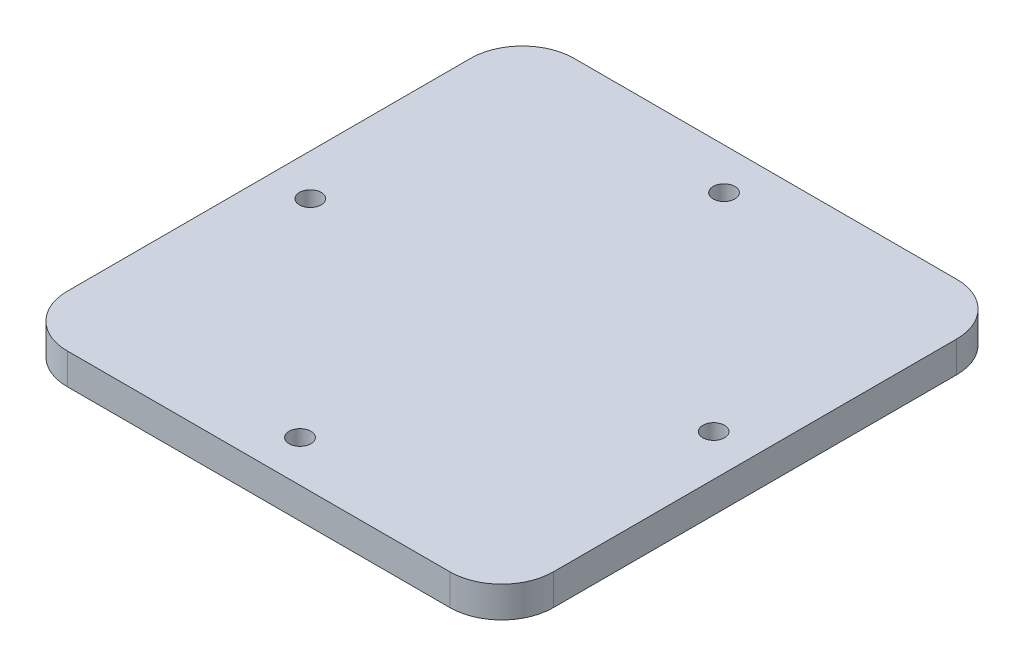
from build123d import *

# Parameters (mm, degrees)
EXTRUDE1_DEPTH    = 6
M5_TAPPED_HOLE2_D = 4.2


with BuildPart() as part:
    # Sketch1 → Extrude1 (new body)
    with BuildSketch(Plane(origin=(0, 0, 0), x_dir=(1, 0, 0), z_dir=(0, 1, 0))):
        with BuildLine():
            Line((10, 0), (84, 0))
            ThreePointArc((84, 0), (91.071067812, 2.928932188), (94, 10))
            Line((94, 10), (94, 88))
            ThreePointArc((94, 88), (91.071067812, 95.071067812), (84, 98))
            Line((84, 98), (10, 98))
            ThreePointArc((10, 98), (2.928932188, 95.071067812), (0, 88))
            Line((0, 88), (0, 10))
            ThreePointArc((0, 10), (2.928932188, 2.928932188), (10, 0))
        make_face()
    extrude(amount=EXTRUDE1_DEPTH)

    # M5 Tapped Hole2 (through all)
    with Locations(Plane(origin=(47, 6, -90), x_dir=(0, 0, 1), z_dir=(0, 1, 0))):
        with Locations((0, 0), (41, -39), (82, 0), (41, 39)):
            Hole(M5_TAPPED_HOLE2_D / 2)


solid = part.part
